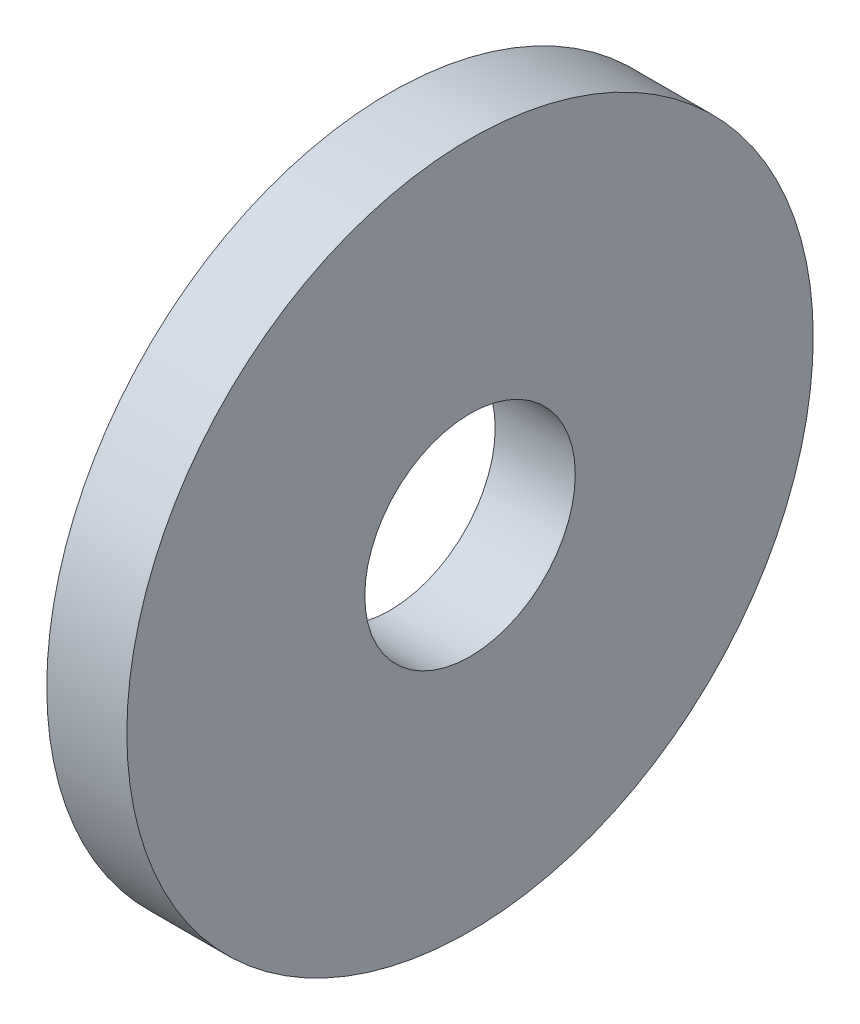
ISO-10303-21;
HEADER;
FILE_DESCRIPTION(('STEP AP214'),'2;1');
FILE_NAME('part.step','',(''),(''),'','','');
FILE_SCHEMA(('AUTOMOTIVE_DESIGN { 1 0 10303 214 1 1 1 1 }'));
ENDSEC;
DATA;
#1=APPLICATION_CONTEXT('core data for automotive mechanical design processes');
#2=APPLICATION_PROTOCOL_DEFINITION('international standard','automotive_design',2000,#1);
#3=PRODUCT_CONTEXT('',#1,'mechanical');
#4=PRODUCT('Part','Part','',(#3));
#5=PRODUCT_RELATED_PRODUCT_CATEGORY('part','',(#4));
#6=PRODUCT_DEFINITION_FORMATION('','',#4);
#7=PRODUCT_DEFINITION_CONTEXT('part definition',#1,'design');
#8=PRODUCT_DEFINITION('design','',#6,#7);
#9=PRODUCT_DEFINITION_SHAPE('','',#8);
#10=(LENGTH_UNIT() NAMED_UNIT(*) SI_UNIT(.MILLI.,.METRE.));
#11=(NAMED_UNIT(*) PLANE_ANGLE_UNIT() SI_UNIT($,.RADIAN.));
#12=(NAMED_UNIT(*) SI_UNIT($,.STERADIAN.) SOLID_ANGLE_UNIT());
#13=UNCERTAINTY_MEASURE_WITH_UNIT(LENGTH_MEASURE(1.E-05),#10,'distance_accuracy_value','');
#14=(GEOMETRIC_REPRESENTATION_CONTEXT(3) GLOBAL_UNCERTAINTY_ASSIGNED_CONTEXT((#13)) GLOBAL_UNIT_ASSIGNED_CONTEXT((#10,
#11,#12)) REPRESENTATION_CONTEXT('',''));
#15=CARTESIAN_POINT('',(0.,0.,0.));
#16=DIRECTION('',(0.,0.,1.));
#17=DIRECTION('',(1.,0.,0.));
#18=AXIS2_PLACEMENT_3D('',#15,#16,#17);
#19=CARTESIAN_POINT('',(-34.9249999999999,0.,0.));
#20=DIRECTION('',(-1.,0.,0.));
#21=DIRECTION('',(0.,0.,1.));
#22=AXIS2_PLACEMENT_3D('',#19,#20,#21);
#23=CYLINDRICAL_SURFACE('',#22,1.84);
#24=CARTESIAN_POINT('',(0.,0.,0.));
#25=DIRECTION('',(-1.,0.,0.));
#26=DIRECTION('',(0.,0.,1.));
#27=AXIS2_PLACEMENT_3D('',#24,#25,#26);
#28=CIRCLE('',#27,1.84);
#29=CARTESIAN_POINT('',(0.,0.,1.84));
#30=VERTEX_POINT('',#29);
#31=EDGE_CURVE('E10',#30,#30,#28,.T.);
#32=ORIENTED_EDGE('',*,*,#31,.F.);
#33=EDGE_LOOP('',(#32));
#34=FACE_BOUND('',#33,.T.);
#35=CARTESIAN_POINT('',(-1.4,0.,0.));
#36=DIRECTION('',(-1.,0.,0.));
#37=DIRECTION('',(0.,0.,1.));
#38=AXIS2_PLACEMENT_3D('',#35,#36,#37);
#39=CIRCLE('',#38,1.84);
#40=CARTESIAN_POINT('',(-1.4,0.,1.84));
#41=VERTEX_POINT('',#40);
#42=EDGE_CURVE('E38',#41,#41,#39,.T.);
#43=ORIENTED_EDGE('',*,*,#42,.T.);
#44=EDGE_LOOP('',(#43));
#45=FACE_BOUND('',#44,.T.);
#46=ADVANCED_FACE('F24',(#34,#45),#23,.F.);
#47=CARTESIAN_POINT('',(0.,1.84,0.));
#48=DIRECTION('',(-1.,0.,0.));
#49=DIRECTION('',(0.,0.,1.));
#50=AXIS2_PLACEMENT_3D('',#47,#48,#49);
#51=PLANE('',#50);
#52=CARTESIAN_POINT('',(0.,0.,0.));
#53=DIRECTION('',(-1.,0.,0.));
#54=DIRECTION('',(0.,0.,1.));
#55=AXIS2_PLACEMENT_3D('',#52,#53,#54);
#56=CIRCLE('',#55,6.);
#57=CARTESIAN_POINT('',(0.,0.,6.));
#58=VERTEX_POINT('',#57);
#59=EDGE_CURVE('E30',#58,#58,#56,.T.);
#60=ORIENTED_EDGE('',*,*,#59,.F.);
#61=EDGE_LOOP('',(#60));
#62=FACE_BOUND('',#61,.T.);
#63=ORIENTED_EDGE('',*,*,#31,.T.);
#64=EDGE_LOOP('',(#63));
#65=FACE_BOUND('',#64,.T.);
#66=ADVANCED_FACE('F53',(#62,#65),#51,.F.);
#67=CARTESIAN_POINT('',(-34.9249999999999,0.,0.));
#68=DIRECTION('',(-1.,0.,0.));
#69=DIRECTION('',(0.,0.,1.));
#70=AXIS2_PLACEMENT_3D('',#67,#68,#69);
#71=CYLINDRICAL_SURFACE('',#70,6.);
#72=CARTESIAN_POINT('',(-1.4,0.,0.));
#73=DIRECTION('',(-1.,0.,0.));
#74=DIRECTION('',(0.,0.,1.));
#75=AXIS2_PLACEMENT_3D('',#72,#73,#74);
#76=CIRCLE('',#75,6.);
#77=CARTESIAN_POINT('',(-1.4,0.,6.));
#78=VERTEX_POINT('',#77);
#79=EDGE_CURVE('E34',#78,#78,#76,.T.);
#80=ORIENTED_EDGE('',*,*,#79,.F.);
#81=EDGE_LOOP('',(#80));
#82=FACE_BOUND('',#81,.T.);
#83=ORIENTED_EDGE('',*,*,#59,.T.);
#84=EDGE_LOOP('',(#83));
#85=FACE_BOUND('',#84,.T.);
#86=ADVANCED_FACE('F48',(#82,#85),#71,.T.);
#87=CARTESIAN_POINT('',(-1.4,6.,0.));
#88=DIRECTION('',(1.,0.,0.));
#89=DIRECTION('',(0.,0.,-1.));
#90=AXIS2_PLACEMENT_3D('',#87,#88,#89);
#91=PLANE('',#90);
#92=ORIENTED_EDGE('',*,*,#42,.F.);
#93=EDGE_LOOP('',(#92));
#94=FACE_BOUND('',#93,.T.);
#95=ORIENTED_EDGE('',*,*,#79,.T.);
#96=EDGE_LOOP('',(#95));
#97=FACE_BOUND('',#96,.T.);
#98=ADVANCED_FACE('F45',(#94,#97),#91,.F.);
#99=CLOSED_SHELL('',(#46,#66,#86,#98));
#100=MANIFOLD_SOLID_BREP('B2',#99);
#101=ADVANCED_BREP_SHAPE_REPRESENTATION('',(#18,#100),#14);
#102=SHAPE_DEFINITION_REPRESENTATION(#9,#101);
ENDSEC;
END-ISO-10303-21;
